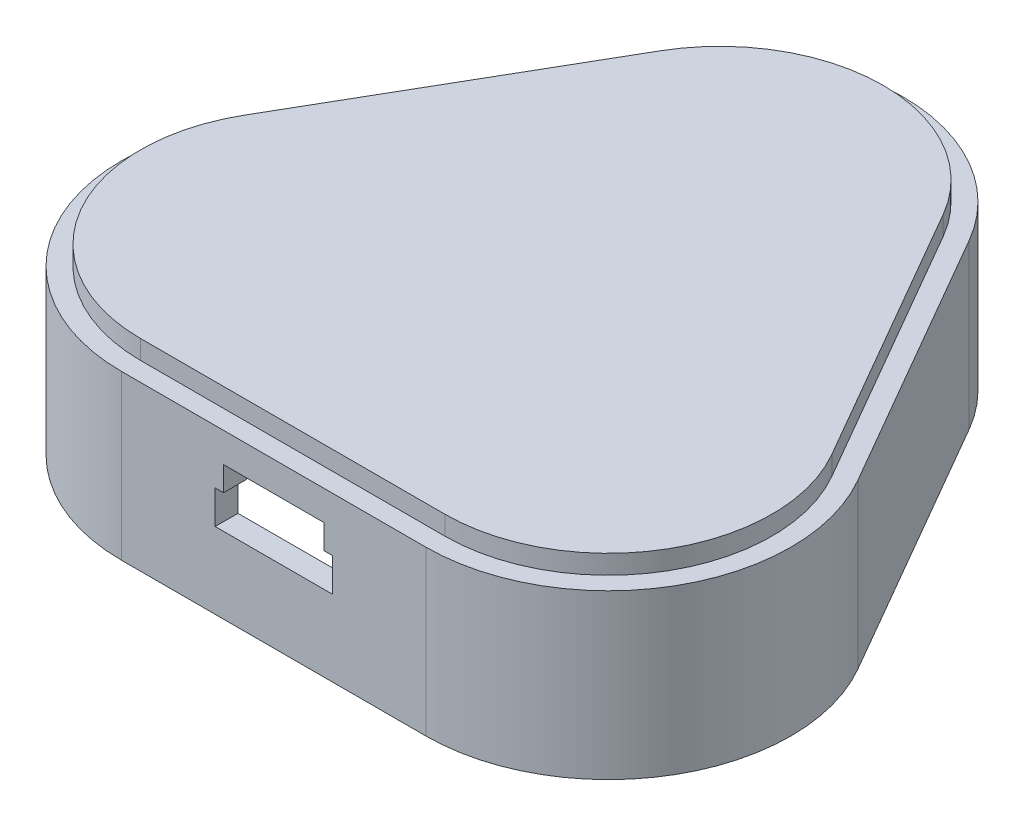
ISO-10303-21;
HEADER;
FILE_DESCRIPTION(('STEP AP214'),'2;1');
FILE_NAME('part.step','',(''),(''),'','','');
FILE_SCHEMA(('AUTOMOTIVE_DESIGN { 1 0 10303 214 1 1 1 1 }'));
ENDSEC;
DATA;
#1=APPLICATION_CONTEXT('core data for automotive mechanical design processes');
#2=APPLICATION_PROTOCOL_DEFINITION('international standard','automotive_design',2000,#1);
#3=PRODUCT_CONTEXT('',#1,'mechanical');
#4=PRODUCT('Part','Part','',(#3));
#5=PRODUCT_RELATED_PRODUCT_CATEGORY('part','',(#4));
#6=PRODUCT_DEFINITION_FORMATION('','',#4);
#7=PRODUCT_DEFINITION_CONTEXT('part definition',#1,'design');
#8=PRODUCT_DEFINITION('design','',#6,#7);
#9=PRODUCT_DEFINITION_SHAPE('','',#8);
#10=(LENGTH_UNIT() NAMED_UNIT(*) SI_UNIT(.MILLI.,.METRE.));
#11=(NAMED_UNIT(*) PLANE_ANGLE_UNIT() SI_UNIT($,.RADIAN.));
#12=(NAMED_UNIT(*) SI_UNIT($,.STERADIAN.) SOLID_ANGLE_UNIT());
#13=UNCERTAINTY_MEASURE_WITH_UNIT(LENGTH_MEASURE(1.E-05),#10,'distance_accuracy_value','');
#14=(GEOMETRIC_REPRESENTATION_CONTEXT(3) GLOBAL_UNCERTAINTY_ASSIGNED_CONTEXT((#13)) GLOBAL_UNIT_ASSIGNED_CONTEXT((#10,
#11,#12)) REPRESENTATION_CONTEXT('',''));
#15=CARTESIAN_POINT('',(0.,0.,0.));
#16=DIRECTION('',(0.,0.,1.));
#17=DIRECTION('',(1.,0.,0.));
#18=AXIS2_PLACEMENT_3D('',#15,#16,#17);
#19=CARTESIAN_POINT('',(0.,10.5,-11.5470053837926));
#20=DIRECTION('',(0.,-1.,0.));
#21=DIRECTION('',(0.,0.,-1.));
#22=AXIS2_PLACEMENT_3D('',#19,#20,#21);
#23=PLANE('',#22);
#24=DIRECTION('',(-0.499999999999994,0.,-0.866025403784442));
#25=VECTOR('',#24,1.);
#26=CARTESIAN_POINT('',(18.2272413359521,10.5,1.02350269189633));
#27=LINE('',#26,#25);
#28=CARTESIAN_POINT('',(12.7712812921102,10.5,-8.42649730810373));
#29=VERTEX_POINT('',#28);
#30=CARTESIAN_POINT('',(8.22724133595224,10.5,-16.2970053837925));
#31=VERTEX_POINT('',#30);
#32=EDGE_CURVE('E546',#29,#31,#27,.T.);
#33=ORIENTED_EDGE('',*,*,#32,.F.);
#34=DIRECTION('',(1.,0.,0.));
#35=VECTOR('',#34,1.);
#36=CARTESIAN_POINT('',(-12.7712812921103,10.5,-8.42649730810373));
#37=LINE('',#36,#35);
#38=CARTESIAN_POINT('',(-12.7712812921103,10.5,-8.42649730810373));
#39=VERTEX_POINT('',#38);
#40=EDGE_CURVE('E320',#39,#29,#37,.T.);
#41=ORIENTED_EDGE('',*,*,#40,.F.);
#42=DIRECTION('',(-0.500000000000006,0.,0.866025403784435));
#43=VECTOR('',#42,1.);
#44=CARTESIAN_POINT('',(-8.22724133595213,10.5,-16.2970053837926));
#45=LINE('',#44,#43);
#46=CARTESIAN_POINT('',(-8.22724133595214,10.5,-16.2970053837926));
#47=VERTEX_POINT('',#46);
#48=EDGE_CURVE('E574',#47,#39,#45,.T.);
#49=ORIENTED_EDGE('',*,*,#48,.F.);
#50=CARTESIAN_POINT('',(0.,10.5,-11.5470053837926));
#51=DIRECTION('',(0.,-1.,0.));
#52=DIRECTION('',(0.,0.,-1.));
#53=AXIS2_PLACEMENT_3D('',#50,#51,#52);
#54=CIRCLE('',#53,9.50000000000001);
#55=EDGE_CURVE('E544',#31,#47,#54,.F.);
#56=ORIENTED_EDGE('',*,*,#55,.F.);
#57=EDGE_LOOP('',(#33,#41,#49,#56));
#58=FACE_BOUND('',#57,.T.);
#59=ADVANCED_FACE('F37',(#58),#23,.T.);
#60=CARTESIAN_POINT('',(-13.9259818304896,10.5,-6.42649730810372));
#61=VERTEX_POINT('',#60);
#62=CARTESIAN_POINT('',(-18.2272413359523,10.5,1.02350269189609));
#63=VERTEX_POINT('',#62);
#64=EDGE_CURVE('E557',#61,#63,#45,.T.);
#65=ORIENTED_EDGE('',*,*,#64,.F.);
#66=DIRECTION('',(-1.,0.,0.));
#67=VECTOR('',#66,1.);
#68=CARTESIAN_POINT('',(-13.9259818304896,10.5,-6.42649730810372));
#69=LINE('',#68,#67);
#70=CARTESIAN_POINT('',(13.9259818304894,10.5,-6.42649730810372));
#71=VERTEX_POINT('',#70);
#72=EDGE_CURVE('E323',#71,#61,#69,.T.);
#73=ORIENTED_EDGE('',*,*,#72,.F.);
#74=CARTESIAN_POINT('',(18.2272413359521,10.5,1.02350269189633));
#75=VERTEX_POINT('',#74);
#76=EDGE_CURVE('E301',#75,#71,#27,.T.);
#77=ORIENTED_EDGE('',*,*,#76,.F.);
#78=CARTESIAN_POINT('',(9.99999999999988,10.5,5.77350269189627));
#79=DIRECTION('',(0.,-1.,0.));
#80=DIRECTION('',(0.,0.,-1.));
#81=AXIS2_PLACEMENT_3D('',#78,#79,#80);
#82=CIRCLE('',#81,9.5);
#83=CARTESIAN_POINT('',(9.99999999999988,10.5,15.2735026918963));
#84=VERTEX_POINT('',#83);
#85=EDGE_CURVE('E549',#84,#75,#82,.F.);
#86=ORIENTED_EDGE('',*,*,#85,.F.);
#87=DIRECTION('',(1.,0.,0.));
#88=VECTOR('',#87,1.);
#89=CARTESIAN_POINT('',(-10.0000000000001,10.5,15.2735026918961));
#90=LINE('',#89,#88);
#91=CARTESIAN_POINT('',(8.9999999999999,10.5,15.2735026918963));
#92=VERTEX_POINT('',#91);
#93=EDGE_CURVE('E551',#92,#84,#90,.T.);
#94=ORIENTED_EDGE('',*,*,#93,.F.);
#95=DIRECTION('',(0.,0.,-1.));
#96=VECTOR('',#95,1.);
#97=CARTESIAN_POINT('',(8.99999999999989,10.5,16.2735026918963));
#98=LINE('',#97,#96);
#99=CARTESIAN_POINT('',(8.99999999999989,10.5,16.2735026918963));
#100=VERTEX_POINT('',#99);
#101=EDGE_CURVE('E353',#100,#92,#98,.T.);
#102=ORIENTED_EDGE('',*,*,#101,.F.);
#103=DIRECTION('',(1.,0.,0.));
#104=VECTOR('',#103,1.);
#105=CARTESIAN_POINT('',(-9.00000000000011,10.5,16.2735026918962));
#106=LINE('',#105,#104);
#107=CARTESIAN_POINT('',(-9.00000000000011,10.5,16.2735026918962));
#108=VERTEX_POINT('',#107);
#109=EDGE_CURVE('E331',#108,#100,#106,.T.);
#110=ORIENTED_EDGE('',*,*,#109,.F.);
#111=DIRECTION('',(0.,0.,-1.));
#112=VECTOR('',#111,1.);
#113=CARTESIAN_POINT('',(-9.00000000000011,10.5,16.2735026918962));
#114=LINE('',#113,#112);
#115=CARTESIAN_POINT('',(-9.00000000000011,10.5,15.2735026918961));
#116=VERTEX_POINT('',#115);
#117=EDGE_CURVE('E341',#108,#116,#114,.T.);
#118=ORIENTED_EDGE('',*,*,#117,.T.);
#119=CARTESIAN_POINT('',(-10.0000000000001,10.5,15.2735026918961));
#120=VERTEX_POINT('',#119);
#121=EDGE_CURVE('E552',#120,#116,#90,.T.);
#122=ORIENTED_EDGE('',*,*,#121,.F.);
#123=CARTESIAN_POINT('',(-10.0000000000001,10.5,5.77350269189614));
#124=DIRECTION('',(0.,-1.,0.));
#125=DIRECTION('',(0.,0.,-1.));
#126=AXIS2_PLACEMENT_3D('',#123,#124,#125);
#127=CIRCLE('',#126,9.5);
#128=EDGE_CURVE('E555',#63,#120,#127,.F.);
#129=ORIENTED_EDGE('',*,*,#128,.F.);
#130=EDGE_LOOP('',(#65,#73,#77,#86,#94,#102,#110,#118,#122,#129));
#131=FACE_BOUND('',#130,.T.);
#132=ADVANCED_FACE('F621',(#131),#23,.T.);
#133=CARTESIAN_POINT('',(-8.22724133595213,65.293332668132,-16.2970053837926));
#134=DIRECTION('',(-0.866025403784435,0.,-0.500000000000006));
#135=DIRECTION('',(-0.500000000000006,0.,0.866025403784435));
#136=AXIS2_PLACEMENT_3D('',#133,#134,#135);
#137=PLANE('',#136);
#138=DIRECTION('',(0.,1.,0.));
#139=VECTOR('',#138,1.);
#140=CARTESIAN_POINT('',(-12.7712812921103,7.5,-8.42649730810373));
#141=LINE('',#140,#139);
#142=CARTESIAN_POINT('',(-12.7712812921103,7.5,-8.42649730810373));
#143=VERTEX_POINT('',#142);
#144=EDGE_CURVE('E52',#143,#39,#141,.T.);
#145=ORIENTED_EDGE('',*,*,#144,.F.);
#146=DIRECTION('',(0.500000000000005,0.,-0.866025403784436));
#147=VECTOR('',#146,1.);
#148=CARTESIAN_POINT('',(-12.7712812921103,7.5,-8.42649730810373));
#149=LINE('',#148,#147);
#150=CARTESIAN_POINT('',(-13.9259818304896,7.5,-6.42649730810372));
#151=VERTEX_POINT('',#150);
#152=EDGE_CURVE('E57',#151,#143,#149,.T.);
#153=ORIENTED_EDGE('',*,*,#152,.F.);
#154=DIRECTION('',(0.,1.,0.));
#155=VECTOR('',#154,1.);
#156=CARTESIAN_POINT('',(-13.9259818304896,7.5,-6.42649730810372));
#157=LINE('',#156,#155);
#158=EDGE_CURVE('E306',#151,#61,#157,.T.);
#159=ORIENTED_EDGE('',*,*,#158,.T.);
#160=ORIENTED_EDGE('',*,*,#64,.T.);
#161=DIRECTION('',(0.,-1.,0.));
#162=VECTOR('',#161,1.);
#163=CARTESIAN_POINT('',(-18.2272413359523,65.293332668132,1.02350269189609));
#164=LINE('',#163,#162);
#165=CARTESIAN_POINT('',(-18.2272413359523,1.25,1.02350269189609));
#166=VERTEX_POINT('',#165);
#167=EDGE_CURVE('E543',#63,#166,#164,.T.);
#168=ORIENTED_EDGE('',*,*,#167,.T.);
#169=DIRECTION('',(-0.500000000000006,0.,0.866025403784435));
#170=VECTOR('',#169,1.);
#171=CARTESIAN_POINT('',(-8.22724133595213,1.25,-16.2970053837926));
#172=LINE('',#171,#170);
#173=CARTESIAN_POINT('',(-8.22724133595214,1.25,-16.2970053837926));
#174=VERTEX_POINT('',#173);
#175=EDGE_CURVE('E45',#174,#166,#172,.T.);
#176=ORIENTED_EDGE('',*,*,#175,.F.);
#177=DIRECTION('',(0.,-1.,0.));
#178=VECTOR('',#177,1.);
#179=CARTESIAN_POINT('',(-8.22724133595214,65.293332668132,-16.2970053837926));
#180=LINE('',#179,#178);
#181=EDGE_CURVE('E569',#47,#174,#180,.T.);
#182=ORIENTED_EDGE('',*,*,#181,.F.);
#183=ORIENTED_EDGE('',*,*,#48,.T.);
#184=EDGE_LOOP('',(#145,#153,#159,#160,#168,#176,#182,#183));
#185=FACE_BOUND('',#184,.T.);
#186=ADVANCED_FACE('F616',(#185),#137,.F.);
#187=CARTESIAN_POINT('',(18.2272413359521,65.293332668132,1.02350269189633));
#188=DIRECTION('',(0.866025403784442,0.,-0.499999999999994));
#189=DIRECTION('',(-0.499999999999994,0.,-0.866025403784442));
#190=AXIS2_PLACEMENT_3D('',#187,#188,#189);
#191=PLANE('',#190);
#192=DIRECTION('',(0.,1.,0.));
#193=VECTOR('',#192,1.);
#194=CARTESIAN_POINT('',(12.7712812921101,7.5,-8.42649730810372));
#195=LINE('',#194,#193);
#196=CARTESIAN_POINT('',(12.7712812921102,7.5,-8.42649730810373));
#197=VERTEX_POINT('',#196);
#198=EDGE_CURVE('E305',#197,#29,#195,.T.);
#199=ORIENTED_EDGE('',*,*,#198,.T.);
#200=ORIENTED_EDGE('',*,*,#32,.T.);
#201=DIRECTION('',(0.,-1.,0.));
#202=VECTOR('',#201,1.);
#203=CARTESIAN_POINT('',(8.22724133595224,65.293332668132,-16.2970053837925));
#204=LINE('',#203,#202);
#205=CARTESIAN_POINT('',(8.22724133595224,1.25,-16.2970053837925));
#206=VERTEX_POINT('',#205);
#207=EDGE_CURVE('E566',#31,#206,#204,.T.);
#208=ORIENTED_EDGE('',*,*,#207,.T.);
#209=DIRECTION('',(-0.499999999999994,0.,-0.866025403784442));
#210=VECTOR('',#209,1.);
#211=CARTESIAN_POINT('',(18.2272413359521,1.25,1.02350269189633));
#212=LINE('',#211,#210);
#213=CARTESIAN_POINT('',(18.2272413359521,1.25,1.02350269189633));
#214=VERTEX_POINT('',#213);
#215=EDGE_CURVE('E535',#214,#206,#212,.T.);
#216=ORIENTED_EDGE('',*,*,#215,.F.);
#217=DIRECTION('',(0.,-1.,0.));
#218=VECTOR('',#217,1.);
#219=CARTESIAN_POINT('',(18.2272413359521,65.293332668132,1.02350269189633));
#220=LINE('',#219,#218);
#221=EDGE_CURVE('E563',#75,#214,#220,.T.);
#222=ORIENTED_EDGE('',*,*,#221,.F.);
#223=ORIENTED_EDGE('',*,*,#76,.T.);
#224=DIRECTION('',(0.,1.,0.));
#225=VECTOR('',#224,1.);
#226=CARTESIAN_POINT('',(13.9259818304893,7.5,-6.42649730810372));
#227=LINE('',#226,#225);
#228=CARTESIAN_POINT('',(13.9259818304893,7.5,-6.42649730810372));
#229=VERTEX_POINT('',#228);
#230=EDGE_CURVE('E294',#229,#71,#227,.T.);
#231=ORIENTED_EDGE('',*,*,#230,.F.);
#232=DIRECTION('',(0.5,0.,0.866025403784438));
#233=VECTOR('',#232,1.);
#234=CARTESIAN_POINT('',(12.7712812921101,7.5,-8.42649730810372));
#235=LINE('',#234,#233);
#236=EDGE_CURVE('E297',#197,#229,#235,.T.);
#237=ORIENTED_EDGE('',*,*,#236,.F.);
#238=EDGE_LOOP('',(#199,#200,#208,#216,#222,#223,#231,#237));
#239=FACE_BOUND('',#238,.T.);
#240=ADVANCED_FACE('F296',(#239),#191,.F.);
#241=CARTESIAN_POINT('',(0.,12.,-11.5470053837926));
#242=DIRECTION('',(0.,-1.,0.));
#243=DIRECTION('',(0.,0.,-1.));
#244=AXIS2_PLACEMENT_3D('',#241,#242,#243);
#245=CYLINDRICAL_SURFACE('',#244,12.);
#246=CARTESIAN_POINT('',(0.,10.75,-11.5470053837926));
#247=DIRECTION('',(0.,1.,0.));
#248=DIRECTION('',(0.,0.,1.));
#249=AXIS2_PLACEMENT_3D('',#246,#247,#248);
#250=CIRCLE('',#249,12.);
#251=CARTESIAN_POINT('',(10.3923048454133,10.75,-17.5470053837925));
#252=VERTEX_POINT('',#251);
#253=CARTESIAN_POINT('',(-10.3923048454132,10.75,-17.5470053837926));
#254=VERTEX_POINT('',#253);
#255=EDGE_CURVE('E463',#252,#254,#250,.T.);
#256=ORIENTED_EDGE('',*,*,#255,.F.);
#257=DIRECTION('',(0.,-1.,0.));
#258=VECTOR('',#257,1.);
#259=CARTESIAN_POINT('',(10.3923048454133,12.,-17.5470053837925));
#260=LINE('',#259,#258);
#261=CARTESIAN_POINT('',(10.3923048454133,0.,-17.5470053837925));
#262=VERTEX_POINT('',#261);
#263=EDGE_CURVE('E594',#252,#262,#260,.T.);
#264=ORIENTED_EDGE('',*,*,#263,.T.);
#265=CARTESIAN_POINT('',(0.,0.,-11.5470053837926));
#266=DIRECTION('',(0.,1.,0.));
#267=DIRECTION('',(0.,0.,-1.));
#268=AXIS2_PLACEMENT_3D('',#265,#266,#267);
#269=CIRCLE('',#268,12.);
#270=CARTESIAN_POINT('',(-10.3923048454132,0.,-17.5470053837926));
#271=VERTEX_POINT('',#270);
#272=EDGE_CURVE('E576',#262,#271,#269,.T.);
#273=ORIENTED_EDGE('',*,*,#272,.T.);
#274=DIRECTION('',(0.,-1.,0.));
#275=VECTOR('',#274,1.);
#276=CARTESIAN_POINT('',(-10.3923048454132,12.,-17.5470053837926));
#277=LINE('',#276,#275);
#278=EDGE_CURVE('E604',#254,#271,#277,.T.);
#279=ORIENTED_EDGE('',*,*,#278,.F.);
#280=EDGE_LOOP('',(#256,#264,#273,#279));
#281=FACE_BOUND('',#280,.T.);
#282=ADVANCED_FACE('F39',(#281),#245,.T.);
#283=CARTESIAN_POINT('',(-10.3923048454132,12.,-17.5470053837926));
#284=DIRECTION('',(0.866025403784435,0.,0.500000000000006));
#285=DIRECTION('',(0.500000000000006,0.,-0.866025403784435));
#286=AXIS2_PLACEMENT_3D('',#283,#284,#285);
#287=PLANE('',#286);
#288=DIRECTION('',(-0.500000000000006,0.,0.866025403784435));
#289=VECTOR('',#288,1.);
#290=CARTESIAN_POINT('',(-10.3923048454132,10.75,-17.5470053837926));
#291=LINE('',#290,#289);
#292=CARTESIAN_POINT('',(-20.3923048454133,10.75,-0.226497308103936));
#293=VERTEX_POINT('',#292);
#294=EDGE_CURVE('E475',#254,#293,#291,.T.);
#295=ORIENTED_EDGE('',*,*,#294,.F.);
#296=ORIENTED_EDGE('',*,*,#278,.T.);
#297=DIRECTION('',(-0.500000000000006,0.,0.866025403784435));
#298=VECTOR('',#297,1.);
#299=CARTESIAN_POINT('',(-10.3923048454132,0.,-17.5470053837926));
#300=LINE('',#299,#298);
#301=CARTESIAN_POINT('',(-20.3923048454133,0.,-0.226497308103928));
#302=VERTEX_POINT('',#301);
#303=EDGE_CURVE('E579',#271,#302,#300,.T.);
#304=ORIENTED_EDGE('',*,*,#303,.T.);
#305=DIRECTION('',(0.,-1.,0.));
#306=VECTOR('',#305,1.);
#307=CARTESIAN_POINT('',(-20.3923048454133,12.,-0.226497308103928));
#308=LINE('',#307,#306);
#309=EDGE_CURVE('E602',#293,#302,#308,.T.);
#310=ORIENTED_EDGE('',*,*,#309,.F.);
#311=EDGE_LOOP('',(#295,#296,#304,#310));
#312=FACE_BOUND('',#311,.T.);
#313=ADVANCED_FACE('F701',(#312),#287,.F.);
#314=CARTESIAN_POINT('',(-10.0000000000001,12.,5.77350269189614));
#315=DIRECTION('',(0.,-1.,0.));
#316=DIRECTION('',(0.,0.,-1.));
#317=AXIS2_PLACEMENT_3D('',#314,#315,#316);
#318=CYLINDRICAL_SURFACE('',#317,12.);
#319=CARTESIAN_POINT('',(-10.0000000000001,10.75,5.77350269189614));
#320=DIRECTION('',(0.,1.,0.));
#321=DIRECTION('',(0.,0.,1.));
#322=AXIS2_PLACEMENT_3D('',#319,#320,#321);
#323=CIRCLE('',#322,12.);
#324=CARTESIAN_POINT('',(-10.0000000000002,10.75,17.7735026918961));
#325=VERTEX_POINT('',#324);
#326=EDGE_CURVE('E477',#293,#325,#323,.T.);
#327=ORIENTED_EDGE('',*,*,#326,.F.);
#328=ORIENTED_EDGE('',*,*,#309,.T.);
#329=CARTESIAN_POINT('',(-10.0000000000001,0.,5.77350269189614));
#330=DIRECTION('',(0.,1.,0.));
#331=DIRECTION('',(0.,0.,1.));
#332=AXIS2_PLACEMENT_3D('',#329,#330,#331);
#333=CIRCLE('',#332,12.);
#334=CARTESIAN_POINT('',(-10.0000000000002,0.,17.7735026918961));
#335=VERTEX_POINT('',#334);
#336=EDGE_CURVE('E582',#302,#335,#333,.T.);
#337=ORIENTED_EDGE('',*,*,#336,.T.);
#338=DIRECTION('',(0.,-1.,0.));
#339=VECTOR('',#338,1.);
#340=CARTESIAN_POINT('',(-10.0000000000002,12.,17.7735026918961));
#341=LINE('',#340,#339);
#342=EDGE_CURVE('E600',#325,#335,#341,.T.);
#343=ORIENTED_EDGE('',*,*,#342,.F.);
#344=EDGE_LOOP('',(#327,#328,#337,#343));
#345=FACE_BOUND('',#344,.T.);
#346=ADVANCED_FACE('F698',(#345),#318,.T.);
#347=CARTESIAN_POINT('',(9.9999999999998,12.,17.7735026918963));
#348=DIRECTION('',(0.,0.,-1.));
#349=DIRECTION('',(-1.,0.,0.));
#350=AXIS2_PLACEMENT_3D('',#347,#348,#349);
#351=PLANE('',#350);
#352=DIRECTION('',(-1.,0.,0.));
#353=VECTOR('',#352,1.);
#354=CARTESIAN_POINT('',(-3.30000000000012,7.2,17.7735026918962));
#355=LINE('',#354,#353);
#356=CARTESIAN_POINT('',(-3.30000000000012,7.2,17.7735026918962));
#357=VERTEX_POINT('',#356);
#358=CARTESIAN_POINT('',(-3.85000000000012,7.2,17.7735026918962));
#359=VERTEX_POINT('',#358);
#360=EDGE_CURVE('E391',#357,#359,#355,.T.);
#361=ORIENTED_EDGE('',*,*,#360,.F.);
#362=DIRECTION('',(0.,-1.,0.));
#363=VECTOR('',#362,1.);
#364=CARTESIAN_POINT('',(-3.30000000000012,8.8,17.7735026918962));
#365=LINE('',#364,#363);
#366=CARTESIAN_POINT('',(-3.30000000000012,8.8,17.7735026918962));
#367=VERTEX_POINT('',#366);
#368=EDGE_CURVE('E394',#367,#357,#365,.T.);
#369=ORIENTED_EDGE('',*,*,#368,.F.);
#370=DIRECTION('',(-1.,0.,0.));
#371=VECTOR('',#370,1.);
#372=CARTESIAN_POINT('',(3.29999999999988,8.8,17.7735026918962));
#373=LINE('',#372,#371);
#374=CARTESIAN_POINT('',(3.2999999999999,8.8,17.7735026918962));
#375=VERTEX_POINT('',#374);
#376=EDGE_CURVE('E401',#375,#367,#373,.T.);
#377=ORIENTED_EDGE('',*,*,#376,.F.);
#378=DIRECTION('',(0.,1.,0.));
#379=VECTOR('',#378,1.);
#380=CARTESIAN_POINT('',(3.29999999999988,8.8,17.7735026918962));
#381=LINE('',#380,#379);
#382=CARTESIAN_POINT('',(3.29999999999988,7.2,17.7735026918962));
#383=VERTEX_POINT('',#382);
#384=EDGE_CURVE('E377',#383,#375,#381,.T.);
#385=ORIENTED_EDGE('',*,*,#384,.F.);
#386=DIRECTION('',(-1.,0.,0.));
#387=VECTOR('',#386,1.);
#388=CARTESIAN_POINT('',(3.29999999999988,7.2,17.7735026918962));
#389=LINE('',#388,#387);
#390=CARTESIAN_POINT('',(3.84999999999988,7.2,17.7735026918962));
#391=VERTEX_POINT('',#390);
#392=EDGE_CURVE('E379',#391,#383,#389,.T.);
#393=ORIENTED_EDGE('',*,*,#392,.F.);
#394=DIRECTION('',(0.,1.,0.));
#395=VECTOR('',#394,1.);
#396=CARTESIAN_POINT('',(3.84999999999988,7.2,17.7735026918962));
#397=LINE('',#396,#395);
#398=CARTESIAN_POINT('',(3.84999999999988,5.,17.7735026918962));
#399=VERTEX_POINT('',#398);
#400=EDGE_CURVE('E382',#399,#391,#397,.T.);
#401=ORIENTED_EDGE('',*,*,#400,.F.);
#402=DIRECTION('',(1.,0.,0.));
#403=VECTOR('',#402,1.);
#404=CARTESIAN_POINT('',(-3.85000000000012,5.,17.7735026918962));
#405=LINE('',#404,#403);
#406=CARTESIAN_POINT('',(-3.85000000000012,5.,17.7735026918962));
#407=VERTEX_POINT('',#406);
#408=EDGE_CURVE('E385',#407,#399,#405,.T.);
#409=ORIENTED_EDGE('',*,*,#408,.F.);
#410=DIRECTION('',(0.,-1.,0.));
#411=VECTOR('',#410,1.);
#412=CARTESIAN_POINT('',(-3.85000000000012,7.2,17.7735026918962));
#413=LINE('',#412,#411);
#414=EDGE_CURVE('E388',#359,#407,#413,.T.);
#415=ORIENTED_EDGE('',*,*,#414,.F.);
#416=EDGE_LOOP('',(#361,#369,#377,#385,#393,#401,#409,#415));
#417=FACE_BOUND('',#416,.T.);
#418=DIRECTION('',(1.,0.,0.));
#419=VECTOR('',#418,1.);
#420=CARTESIAN_POINT('',(-10.0000000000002,10.75,17.7735026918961));
#421=LINE('',#420,#419);
#422=CARTESIAN_POINT('',(9.99999999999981,10.75,17.7735026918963));
#423=VERTEX_POINT('',#422);
#424=EDGE_CURVE('E479',#325,#423,#421,.T.);
#425=ORIENTED_EDGE('',*,*,#424,.F.);
#426=ORIENTED_EDGE('',*,*,#342,.T.);
#427=DIRECTION('',(1.,0.,0.));
#428=VECTOR('',#427,1.);
#429=CARTESIAN_POINT('',(9.9999999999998,0.,17.7735026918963));
#430=LINE('',#429,#428);
#431=CARTESIAN_POINT('',(9.9999999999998,0.,17.7735026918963));
#432=VERTEX_POINT('',#431);
#433=EDGE_CURVE('E585',#335,#432,#430,.T.);
#434=ORIENTED_EDGE('',*,*,#433,.T.);
#435=DIRECTION('',(0.,-1.,0.));
#436=VECTOR('',#435,1.);
#437=CARTESIAN_POINT('',(9.9999999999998,12.,17.7735026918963));
#438=LINE('',#437,#436);
#439=EDGE_CURVE('E598',#423,#432,#438,.T.);
#440=ORIENTED_EDGE('',*,*,#439,.F.);
#441=EDGE_LOOP('',(#425,#426,#434,#440));
#442=FACE_BOUND('',#441,.T.);
#443=ADVANCED_FACE('F694',(#417,#442),#351,.F.);
#444=CARTESIAN_POINT('',(9.99999999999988,12.,5.77350269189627));
#445=DIRECTION('',(0.,-1.,0.));
#446=DIRECTION('',(0.,0.,-1.));
#447=AXIS2_PLACEMENT_3D('',#444,#445,#446);
#448=CYLINDRICAL_SURFACE('',#447,12.);
#449=CARTESIAN_POINT('',(9.99999999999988,10.75,5.77350269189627));
#450=DIRECTION('',(0.,1.,0.));
#451=DIRECTION('',(0.,0.,1.));
#452=AXIS2_PLACEMENT_3D('',#449,#450,#451);
#453=CIRCLE('',#452,12.);
#454=CARTESIAN_POINT('',(20.3923048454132,10.75,-0.226497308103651));
#455=VERTEX_POINT('',#454);
#456=EDGE_CURVE('E481',#423,#455,#453,.T.);
#457=ORIENTED_EDGE('',*,*,#456,.F.);
#458=ORIENTED_EDGE('',*,*,#439,.T.);
#459=CARTESIAN_POINT('',(9.99999999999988,0.,5.77350269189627));
#460=DIRECTION('',(0.,1.,0.));
#461=DIRECTION('',(0.,0.,-1.));
#462=AXIS2_PLACEMENT_3D('',#459,#460,#461);
#463=CIRCLE('',#462,12.);
#464=CARTESIAN_POINT('',(20.3923048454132,0.,-0.226497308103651));
#465=VERTEX_POINT('',#464);
#466=EDGE_CURVE('E588',#432,#465,#463,.T.);
#467=ORIENTED_EDGE('',*,*,#466,.T.);
#468=DIRECTION('',(0.,-1.,0.));
#469=VECTOR('',#468,1.);
#470=CARTESIAN_POINT('',(20.3923048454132,12.,-0.226497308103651));
#471=LINE('',#470,#469);
#472=EDGE_CURVE('E596',#455,#465,#471,.T.);
#473=ORIENTED_EDGE('',*,*,#472,.F.);
#474=EDGE_LOOP('',(#457,#458,#467,#473));
#475=FACE_BOUND('',#474,.T.);
#476=ADVANCED_FACE('F690',(#475),#448,.T.);
#477=CARTESIAN_POINT('',(10.3923048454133,12.,-17.5470053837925));
#478=DIRECTION('',(-0.866025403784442,0.,0.499999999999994));
#479=DIRECTION('',(0.499999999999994,0.,0.866025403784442));
#480=AXIS2_PLACEMENT_3D('',#477,#478,#479);
#481=PLANE('',#480);
#482=DIRECTION('',(-0.499999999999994,0.,-0.866025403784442));
#483=VECTOR('',#482,1.);
#484=CARTESIAN_POINT('',(20.3923048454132,10.75,-0.226497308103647));
#485=LINE('',#484,#483);
#486=EDGE_CURVE('E483',#455,#252,#485,.T.);
#487=ORIENTED_EDGE('',*,*,#486,.F.);
#488=ORIENTED_EDGE('',*,*,#472,.T.);
#489=DIRECTION('',(-0.499999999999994,0.,-0.866025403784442));
#490=VECTOR('',#489,1.);
#491=CARTESIAN_POINT('',(10.3923048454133,0.,-17.5470053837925));
#492=LINE('',#491,#490);
#493=EDGE_CURVE('E591',#465,#262,#492,.T.);
#494=ORIENTED_EDGE('',*,*,#493,.T.);
#495=ORIENTED_EDGE('',*,*,#263,.F.);
#496=EDGE_LOOP('',(#487,#488,#494,#495));
#497=FACE_BOUND('',#496,.T.);
#498=ADVANCED_FACE('F686',(#497),#481,.F.);
#499=CARTESIAN_POINT('',(0.,0.,-11.5470053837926));
#500=DIRECTION('',(0.,-1.,0.));
#501=DIRECTION('',(0.,0.,-1.));
#502=AXIS2_PLACEMENT_3D('',#499,#500,#501);
#503=PLANE('',#502);
#504=CARTESIAN_POINT('',(0.,0.,-11.5470053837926));
#505=DIRECTION('',(0.,-1.,0.));
#506=DIRECTION('',(0.,0.,-1.));
#507=AXIS2_PLACEMENT_3D('',#504,#505,#506);
#508=CIRCLE('',#507,10.75);
#509=CARTESIAN_POINT('',(-9.30977309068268,0.,-16.9220053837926));
#510=VERTEX_POINT('',#509);
#511=CARTESIAN_POINT('',(9.30977309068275,0.,-16.9220053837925));
#512=VERTEX_POINT('',#511);
#513=EDGE_CURVE('E485',#510,#512,#508,.T.);
#514=ORIENTED_EDGE('',*,*,#513,.F.);
#515=DIRECTION('',(0.500000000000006,0.,-0.866025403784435));
#516=VECTOR('',#515,1.);
#517=CARTESIAN_POINT('',(-19.3097730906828,0.,0.39850269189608));
#518=LINE('',#517,#516);
#519=CARTESIAN_POINT('',(-19.3097730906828,0.,0.398502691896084));
#520=VERTEX_POINT('',#519);
#521=EDGE_CURVE('E490',#520,#510,#518,.T.);
#522=ORIENTED_EDGE('',*,*,#521,.F.);
#523=CARTESIAN_POINT('',(-10.0000000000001,0.,5.77350269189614));
#524=DIRECTION('',(0.,-1.,0.));
#525=DIRECTION('',(0.,0.,-1.));
#526=AXIS2_PLACEMENT_3D('',#523,#524,#525);
#527=CIRCLE('',#526,10.75);
#528=CARTESIAN_POINT('',(-10.0000000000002,0.,16.5235026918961));
#529=VERTEX_POINT('',#528);
#530=EDGE_CURVE('E516',#529,#520,#527,.T.);
#531=ORIENTED_EDGE('',*,*,#530,.F.);
#532=DIRECTION('',(-1.,0.,0.));
#533=VECTOR('',#532,1.);
#534=CARTESIAN_POINT('',(9.99999999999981,0.,16.5235026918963));
#535=LINE('',#534,#533);
#536=CARTESIAN_POINT('',(9.99999999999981,0.,16.5235026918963));
#537=VERTEX_POINT('',#536);
#538=EDGE_CURVE('E513',#537,#529,#535,.T.);
#539=ORIENTED_EDGE('',*,*,#538,.F.);
#540=CARTESIAN_POINT('',(9.99999999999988,0.,5.77350269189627));
#541=DIRECTION('',(0.,-1.,0.));
#542=DIRECTION('',(0.,0.,-1.));
#543=AXIS2_PLACEMENT_3D('',#540,#541,#542);
#544=CIRCLE('',#543,10.75);
#545=CARTESIAN_POINT('',(19.3097730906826,0.,0.398502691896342));
#546=VERTEX_POINT('',#545);
#547=EDGE_CURVE('E510',#546,#537,#544,.T.);
#548=ORIENTED_EDGE('',*,*,#547,.F.);
#549=DIRECTION('',(0.499999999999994,0.,0.866025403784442));
#550=VECTOR('',#549,1.);
#551=CARTESIAN_POINT('',(9.30977309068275,0.,-16.9220053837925));
#552=LINE('',#551,#550);
#553=EDGE_CURVE('E507',#512,#546,#552,.T.);
#554=ORIENTED_EDGE('',*,*,#553,.F.);
#555=EDGE_LOOP('',(#514,#522,#531,#539,#548,#554));
#556=FACE_BOUND('',#555,.T.);
#557=ORIENTED_EDGE('',*,*,#272,.F.);
#558=ORIENTED_EDGE('',*,*,#493,.F.);
#559=ORIENTED_EDGE('',*,*,#466,.F.);
#560=ORIENTED_EDGE('',*,*,#433,.F.);
#561=ORIENTED_EDGE('',*,*,#336,.F.);
#562=ORIENTED_EDGE('',*,*,#303,.F.);
#563=EDGE_LOOP('',(#557,#558,#559,#560,#561,#562));
#564=FACE_BOUND('',#563,.T.);
#565=ADVANCED_FACE('F683',(#556,#564),#503,.T.);
#566=CARTESIAN_POINT('',(0.,1.25,-11.5470053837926));
#567=DIRECTION('',(0.,-1.,0.));
#568=DIRECTION('',(0.,0.,-1.));
#569=AXIS2_PLACEMENT_3D('',#566,#567,#568);
#570=PLANE('',#569);
#571=CARTESIAN_POINT('',(0.,1.25,-11.5470053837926));
#572=DIRECTION('',(0.,-1.,0.));
#573=DIRECTION('',(0.,0.,-1.));
#574=AXIS2_PLACEMENT_3D('',#571,#572,#573);
#575=CIRCLE('',#574,10.75);
#576=CARTESIAN_POINT('',(-9.30977309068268,1.25,-16.9220053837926));
#577=VERTEX_POINT('',#576);
#578=CARTESIAN_POINT('',(9.30977309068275,1.25,-16.9220053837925));
#579=VERTEX_POINT('',#578);
#580=EDGE_CURVE('E486',#577,#579,#575,.T.);
#581=ORIENTED_EDGE('',*,*,#580,.T.);
#582=DIRECTION('',(0.499999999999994,0.,0.866025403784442));
#583=VECTOR('',#582,1.);
#584=CARTESIAN_POINT('',(9.30977309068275,1.25,-16.9220053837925));
#585=LINE('',#584,#583);
#586=CARTESIAN_POINT('',(19.3097730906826,1.25,0.398502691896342));
#587=VERTEX_POINT('',#586);
#588=EDGE_CURVE('E489',#579,#587,#585,.T.);
#589=ORIENTED_EDGE('',*,*,#588,.T.);
#590=CARTESIAN_POINT('',(9.99999999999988,1.25,5.77350269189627));
#591=DIRECTION('',(0.,-1.,0.));
#592=DIRECTION('',(0.,0.,-1.));
#593=AXIS2_PLACEMENT_3D('',#590,#591,#592);
#594=CIRCLE('',#593,10.75);
#595=CARTESIAN_POINT('',(9.99999999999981,1.25,16.5235026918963));
#596=VERTEX_POINT('',#595);
#597=EDGE_CURVE('E493',#587,#596,#594,.T.);
#598=ORIENTED_EDGE('',*,*,#597,.T.);
#599=DIRECTION('',(-1.,0.,0.));
#600=VECTOR('',#599,1.);
#601=CARTESIAN_POINT('',(9.99999999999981,1.25,16.5235026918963));
#602=LINE('',#601,#600);
#603=CARTESIAN_POINT('',(-10.0000000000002,1.25,16.5235026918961));
#604=VERTEX_POINT('',#603);
#605=EDGE_CURVE('E496',#596,#604,#602,.T.);
#606=ORIENTED_EDGE('',*,*,#605,.T.);
#607=CARTESIAN_POINT('',(-10.0000000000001,1.25,5.77350269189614));
#608=DIRECTION('',(0.,-1.,0.));
#609=DIRECTION('',(0.,0.,-1.));
#610=AXIS2_PLACEMENT_3D('',#607,#608,#609);
#611=CIRCLE('',#610,10.75);
#612=CARTESIAN_POINT('',(-19.3097730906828,1.25,0.398502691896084));
#613=VERTEX_POINT('',#612);
#614=EDGE_CURVE('E499',#604,#613,#611,.T.);
#615=ORIENTED_EDGE('',*,*,#614,.T.);
#616=DIRECTION('',(0.500000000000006,0.,-0.866025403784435));
#617=VECTOR('',#616,1.);
#618=CARTESIAN_POINT('',(-19.3097730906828,1.25,0.39850269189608));
#619=LINE('',#618,#617);
#620=EDGE_CURVE('E502',#613,#577,#619,.T.);
#621=ORIENTED_EDGE('',*,*,#620,.T.);
#622=EDGE_LOOP('',(#581,#589,#598,#606,#615,#621));
#623=FACE_BOUND('',#622,.T.);
#624=CARTESIAN_POINT('',(-10.0000000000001,1.25,5.77350269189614));
#625=DIRECTION('',(0.,-1.,0.));
#626=DIRECTION('',(0.,0.,-1.));
#627=AXIS2_PLACEMENT_3D('',#624,#625,#626);
#628=CIRCLE('',#627,9.5);
#629=CARTESIAN_POINT('',(-10.0000000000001,1.25,15.2735026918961));
#630=VERTEX_POINT('',#629);
#631=EDGE_CURVE('E541',#166,#630,#628,.F.);
#632=ORIENTED_EDGE('',*,*,#631,.T.);
#633=DIRECTION('',(1.,0.,0.));
#634=VECTOR('',#633,1.);
#635=CARTESIAN_POINT('',(-10.0000000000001,1.25,15.2735026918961));
#636=LINE('',#635,#634);
#637=CARTESIAN_POINT('',(9.99999999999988,1.25,15.2735026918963));
#638=VERTEX_POINT('',#637);
#639=EDGE_CURVE('E539',#630,#638,#636,.T.);
#640=ORIENTED_EDGE('',*,*,#639,.T.);
#641=CARTESIAN_POINT('',(9.99999999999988,1.25,5.77350269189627));
#642=DIRECTION('',(0.,-1.,0.));
#643=DIRECTION('',(0.,0.,-1.));
#644=AXIS2_PLACEMENT_3D('',#641,#642,#643);
#645=CIRCLE('',#644,9.5);
#646=EDGE_CURVE('E537',#638,#214,#645,.F.);
#647=ORIENTED_EDGE('',*,*,#646,.T.);
#648=ORIENTED_EDGE('',*,*,#215,.T.);
#649=CARTESIAN_POINT('',(0.,1.25,-11.5470053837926));
#650=DIRECTION('',(0.,-1.,0.));
#651=DIRECTION('',(0.,0.,-1.));
#652=AXIS2_PLACEMENT_3D('',#649,#650,#651);
#653=CIRCLE('',#652,9.50000000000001);
#654=EDGE_CURVE('E523',#206,#174,#653,.F.);
#655=ORIENTED_EDGE('',*,*,#654,.T.);
#656=ORIENTED_EDGE('',*,*,#175,.T.);
#657=EDGE_LOOP('',(#632,#640,#647,#648,#655,#656));
#658=FACE_BOUND('',#657,.T.);
#659=ADVANCED_FACE('F608',(#623,#658),#570,.T.);
#660=CARTESIAN_POINT('',(0.,1.25,-11.5470053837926));
#661=DIRECTION('',(0.,-1.,0.));
#662=DIRECTION('',(0.,0.,-1.));
#663=AXIS2_PLACEMENT_3D('',#660,#661,#662);
#664=CYLINDRICAL_SURFACE('',#663,10.75);
#665=ORIENTED_EDGE('',*,*,#513,.T.);
#666=DIRECTION('',(0.,-1.,0.));
#667=VECTOR('',#666,1.);
#668=CARTESIAN_POINT('',(9.30977309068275,1.25,-16.9220053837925));
#669=LINE('',#668,#667);
#670=EDGE_CURVE('E505',#579,#512,#669,.T.);
#671=ORIENTED_EDGE('',*,*,#670,.F.);
#672=ORIENTED_EDGE('',*,*,#580,.F.);
#673=DIRECTION('',(0.,-1.,0.));
#674=VECTOR('',#673,1.);
#675=CARTESIAN_POINT('',(-9.30977309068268,1.25,-16.9220053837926));
#676=LINE('',#675,#674);
#677=EDGE_CURVE('E521',#577,#510,#676,.T.);
#678=ORIENTED_EDGE('',*,*,#677,.T.);
#679=EDGE_LOOP('',(#665,#671,#672,#678));
#680=FACE_BOUND('',#679,.T.);
#681=ADVANCED_FACE('F661',(#680),#664,.F.);
#682=CARTESIAN_POINT('',(-19.3097730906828,1.25,0.39850269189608));
#683=DIRECTION('',(-0.866025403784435,0.,-0.500000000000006));
#684=DIRECTION('',(-0.500000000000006,0.,0.866025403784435));
#685=AXIS2_PLACEMENT_3D('',#682,#683,#684);
#686=PLANE('',#685);
#687=ORIENTED_EDGE('',*,*,#521,.T.);
#688=ORIENTED_EDGE('',*,*,#677,.F.);
#689=ORIENTED_EDGE('',*,*,#620,.F.);
#690=DIRECTION('',(0.,-1.,0.));
#691=VECTOR('',#690,1.);
#692=CARTESIAN_POINT('',(-19.3097730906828,1.25,0.398502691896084));
#693=LINE('',#692,#691);
#694=EDGE_CURVE('E524',#613,#520,#693,.T.);
#695=ORIENTED_EDGE('',*,*,#694,.T.);
#696=EDGE_LOOP('',(#687,#688,#689,#695));
#697=FACE_BOUND('',#696,.T.);
#698=ADVANCED_FACE('F746',(#697),#686,.F.);
#699=CARTESIAN_POINT('',(-10.0000000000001,1.25,5.77350269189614));
#700=DIRECTION('',(0.,-1.,0.));
#701=DIRECTION('',(0.,0.,-1.));
#702=AXIS2_PLACEMENT_3D('',#699,#700,#701);
#703=CYLINDRICAL_SURFACE('',#702,10.75);
#704=ORIENTED_EDGE('',*,*,#530,.T.);
#705=ORIENTED_EDGE('',*,*,#694,.F.);
#706=ORIENTED_EDGE('',*,*,#614,.F.);
#707=DIRECTION('',(0.,-1.,0.));
#708=VECTOR('',#707,1.);
#709=CARTESIAN_POINT('',(-10.0000000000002,1.25,16.5235026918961));
#710=LINE('',#709,#708);
#711=EDGE_CURVE('E526',#604,#529,#710,.T.);
#712=ORIENTED_EDGE('',*,*,#711,.T.);
#713=EDGE_LOOP('',(#704,#705,#706,#712));
#714=FACE_BOUND('',#713,.T.);
#715=ADVANCED_FACE('F749',(#714),#703,.F.);
#716=CARTESIAN_POINT('',(9.99999999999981,1.25,16.5235026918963));
#717=DIRECTION('',(0.,0.,1.));
#718=DIRECTION('',(1.,0.,0.));
#719=AXIS2_PLACEMENT_3D('',#716,#717,#718);
#720=PLANE('',#719);
#721=ORIENTED_EDGE('',*,*,#538,.T.);
#722=ORIENTED_EDGE('',*,*,#711,.F.);
#723=ORIENTED_EDGE('',*,*,#605,.F.);
#724=DIRECTION('',(0.,-1.,0.));
#725=VECTOR('',#724,1.);
#726=CARTESIAN_POINT('',(9.99999999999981,1.25,16.5235026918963));
#727=LINE('',#726,#725);
#728=EDGE_CURVE('E528',#596,#537,#727,.T.);
#729=ORIENTED_EDGE('',*,*,#728,.T.);
#730=EDGE_LOOP('',(#721,#722,#723,#729));
#731=FACE_BOUND('',#730,.T.);
#732=ADVANCED_FACE('F753',(#731),#720,.F.);
#733=CARTESIAN_POINT('',(9.99999999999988,1.25,5.77350269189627));
#734=DIRECTION('',(0.,-1.,0.));
#735=DIRECTION('',(0.,0.,-1.));
#736=AXIS2_PLACEMENT_3D('',#733,#734,#735);
#737=CYLINDRICAL_SURFACE('',#736,10.75);
#738=ORIENTED_EDGE('',*,*,#547,.T.);
#739=ORIENTED_EDGE('',*,*,#728,.F.);
#740=ORIENTED_EDGE('',*,*,#597,.F.);
#741=DIRECTION('',(0.,-1.,0.));
#742=VECTOR('',#741,1.);
#743=CARTESIAN_POINT('',(19.3097730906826,1.25,0.398502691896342));
#744=LINE('',#743,#742);
#745=EDGE_CURVE('E530',#587,#546,#744,.T.);
#746=ORIENTED_EDGE('',*,*,#745,.T.);
#747=EDGE_LOOP('',(#738,#739,#740,#746));
#748=FACE_BOUND('',#747,.T.);
#749=ADVANCED_FACE('F757',(#748),#737,.F.);
#750=CARTESIAN_POINT('',(9.30977309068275,1.25,-16.9220053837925));
#751=DIRECTION('',(0.866025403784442,0.,-0.499999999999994));
#752=DIRECTION('',(-0.499999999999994,0.,-0.866025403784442));
#753=AXIS2_PLACEMENT_3D('',#750,#751,#752);
#754=PLANE('',#753);
#755=ORIENTED_EDGE('',*,*,#553,.T.);
#756=ORIENTED_EDGE('',*,*,#745,.F.);
#757=ORIENTED_EDGE('',*,*,#588,.F.);
#758=ORIENTED_EDGE('',*,*,#670,.T.);
#759=EDGE_LOOP('',(#755,#756,#757,#758));
#760=FACE_BOUND('',#759,.T.);
#761=ADVANCED_FACE('F671',(#760),#754,.F.);
#762=CARTESIAN_POINT('',(0.,65.293332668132,-11.5470053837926));
#763=DIRECTION('',(0.,-1.,0.));
#764=DIRECTION('',(0.,0.,-1.));
#765=AXIS2_PLACEMENT_3D('',#762,#763,#764);
#766=CYLINDRICAL_SURFACE('',#765,9.50000000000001);
#767=ORIENTED_EDGE('',*,*,#654,.F.);
#768=ORIENTED_EDGE('',*,*,#207,.F.);
#769=ORIENTED_EDGE('',*,*,#55,.T.);
#770=ORIENTED_EDGE('',*,*,#181,.T.);
#771=EDGE_LOOP('',(#767,#768,#769,#770));
#772=FACE_BOUND('',#771,.T.);
#773=ADVANCED_FACE('F634',(#772),#766,.F.);
#774=CARTESIAN_POINT('',(9.99999999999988,65.293332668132,5.77350269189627));
#775=DIRECTION('',(0.,-1.,0.));
#776=DIRECTION('',(0.,0.,-1.));
#777=AXIS2_PLACEMENT_3D('',#774,#775,#776);
#778=CYLINDRICAL_SURFACE('',#777,9.5);
#779=ORIENTED_EDGE('',*,*,#646,.F.);
#780=DIRECTION('',(0.,-1.,0.));
#781=VECTOR('',#780,1.);
#782=CARTESIAN_POINT('',(9.99999999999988,65.293332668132,15.2735026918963));
#783=LINE('',#782,#781);
#784=EDGE_CURVE('E560',#84,#638,#783,.T.);
#785=ORIENTED_EDGE('',*,*,#784,.F.);
#786=ORIENTED_EDGE('',*,*,#85,.T.);
#787=ORIENTED_EDGE('',*,*,#221,.T.);
#788=EDGE_LOOP('',(#779,#785,#786,#787));
#789=FACE_BOUND('',#788,.T.);
#790=ADVANCED_FACE('F630',(#789),#778,.F.);
#791=CARTESIAN_POINT('',(-10.0000000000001,65.293332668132,15.2735026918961));
#792=DIRECTION('',(0.,0.,1.));
#793=DIRECTION('',(1.,0.,0.));
#794=AXIS2_PLACEMENT_3D('',#791,#792,#793);
#795=PLANE('',#794);
#796=ORIENTED_EDGE('',*,*,#121,.T.);
#797=DIRECTION('',(0.,1.,0.));
#798=VECTOR('',#797,1.);
#799=CARTESIAN_POINT('',(-9.0000000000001,10.5,15.2735026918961));
#800=LINE('',#799,#798);
#801=CARTESIAN_POINT('',(-9.0000000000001,2.5,15.2735026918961));
#802=VERTEX_POINT('',#801);
#803=EDGE_CURVE('E327',#802,#116,#800,.T.);
#804=ORIENTED_EDGE('',*,*,#803,.F.);
#805=DIRECTION('',(-1.,0.,0.));
#806=VECTOR('',#805,1.);
#807=CARTESIAN_POINT('',(-9.0000000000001,2.5,15.2735026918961));
#808=LINE('',#807,#806);
#809=CARTESIAN_POINT('',(8.99999999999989,2.5,15.2735026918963));
#810=VERTEX_POINT('',#809);
#811=EDGE_CURVE('E332',#810,#802,#808,.T.);
#812=ORIENTED_EDGE('',*,*,#811,.F.);
#813=DIRECTION('',(0.,-1.,0.));
#814=VECTOR('',#813,1.);
#815=CARTESIAN_POINT('',(8.9999999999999,10.5,15.2735026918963));
#816=LINE('',#815,#814);
#817=EDGE_CURVE('E343',#92,#810,#816,.T.);
#818=ORIENTED_EDGE('',*,*,#817,.F.);
#819=ORIENTED_EDGE('',*,*,#93,.T.);
#820=ORIENTED_EDGE('',*,*,#784,.T.);
#821=ORIENTED_EDGE('',*,*,#639,.F.);
#822=DIRECTION('',(0.,-1.,0.));
#823=VECTOR('',#822,1.);
#824=CARTESIAN_POINT('',(-10.0000000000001,65.293332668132,15.2735026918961));
#825=LINE('',#824,#823);
#826=EDGE_CURVE('E547',#120,#630,#825,.T.);
#827=ORIENTED_EDGE('',*,*,#826,.F.);
#828=EDGE_LOOP('',(#796,#804,#812,#818,#819,#820,#821,#827));
#829=FACE_BOUND('',#828,.T.);
#830=ADVANCED_FACE('F625',(#829),#795,.F.);
#831=CARTESIAN_POINT('',(-10.0000000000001,65.293332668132,5.77350269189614));
#832=DIRECTION('',(0.,-1.,0.));
#833=DIRECTION('',(0.,0.,-1.));
#834=AXIS2_PLACEMENT_3D('',#831,#832,#833);
#835=CYLINDRICAL_SURFACE('',#834,9.5);
#836=ORIENTED_EDGE('',*,*,#631,.F.);
#837=ORIENTED_EDGE('',*,*,#167,.F.);
#838=ORIENTED_EDGE('',*,*,#128,.T.);
#839=ORIENTED_EDGE('',*,*,#826,.T.);
#840=EDGE_LOOP('',(#836,#837,#838,#839));
#841=FACE_BOUND('',#840,.T.);
#842=ADVANCED_FACE('F614',(#841),#835,.F.);
#843=CARTESIAN_POINT('',(0.,10.75,-11.5470053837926));
#844=DIRECTION('',(0.,1.,0.));
#845=DIRECTION('',(0.,0.,1.));
#846=AXIS2_PLACEMENT_3D('',#843,#844,#845);
#847=PLANE('',#846);
#848=DIRECTION('',(-0.499999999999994,0.,-0.866025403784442));
#849=VECTOR('',#848,1.);
#850=CARTESIAN_POINT('',(19.3097730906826,10.75,0.398502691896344));
#851=LINE('',#850,#849);
#852=CARTESIAN_POINT('',(19.3097730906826,10.75,0.398502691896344));
#853=VERTEX_POINT('',#852);
#854=CARTESIAN_POINT('',(9.30977309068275,10.75,-16.9220053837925));
#855=VERTEX_POINT('',#854);
#856=EDGE_CURVE('E441',#853,#855,#851,.T.);
#857=ORIENTED_EDGE('',*,*,#856,.F.);
#858=CARTESIAN_POINT('',(9.99999999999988,10.75,5.77350269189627));
#859=DIRECTION('',(0.,1.,0.));
#860=DIRECTION('',(0.,0.,1.));
#861=AXIS2_PLACEMENT_3D('',#858,#859,#860);
#862=CIRCLE('',#861,10.75);
#863=CARTESIAN_POINT('',(9.99999999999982,10.75,16.5235026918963));
#864=VERTEX_POINT('',#863);
#865=EDGE_CURVE('E438',#864,#853,#862,.T.);
#866=ORIENTED_EDGE('',*,*,#865,.F.);
#867=DIRECTION('',(1.,0.,0.));
#868=VECTOR('',#867,1.);
#869=CARTESIAN_POINT('',(-10.0000000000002,10.75,16.5235026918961));
#870=LINE('',#869,#868);
#871=CARTESIAN_POINT('',(-10.0000000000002,10.75,16.5235026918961));
#872=VERTEX_POINT('',#871);
#873=EDGE_CURVE('E435',#872,#864,#870,.T.);
#874=ORIENTED_EDGE('',*,*,#873,.F.);
#875=CARTESIAN_POINT('',(-10.0000000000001,10.75,5.77350269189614));
#876=DIRECTION('',(0.,1.,0.));
#877=DIRECTION('',(0.,0.,1.));
#878=AXIS2_PLACEMENT_3D('',#875,#876,#877);
#879=CIRCLE('',#878,10.75);
#880=CARTESIAN_POINT('',(-19.3097730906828,10.75,0.398502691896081));
#881=VERTEX_POINT('',#880);
#882=EDGE_CURVE('E432',#881,#872,#879,.T.);
#883=ORIENTED_EDGE('',*,*,#882,.F.);
#884=DIRECTION('',(-0.500000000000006,0.,0.866025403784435));
#885=VECTOR('',#884,1.);
#886=CARTESIAN_POINT('',(-9.30977309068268,10.75,-16.9220053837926));
#887=LINE('',#886,#885);
#888=CARTESIAN_POINT('',(-9.30977309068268,10.75,-16.9220053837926));
#889=VERTEX_POINT('',#888);
#890=EDGE_CURVE('E428',#889,#881,#887,.T.);
#891=ORIENTED_EDGE('',*,*,#890,.F.);
#892=CARTESIAN_POINT('',(0.,10.75,-11.5470053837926));
#893=DIRECTION('',(0.,1.,0.));
#894=DIRECTION('',(0.,0.,1.));
#895=AXIS2_PLACEMENT_3D('',#892,#893,#894);
#896=CIRCLE('',#895,10.75);
#897=EDGE_CURVE('E425',#855,#889,#896,.T.);
#898=ORIENTED_EDGE('',*,*,#897,.F.);
#899=EDGE_LOOP('',(#857,#866,#874,#883,#891,#898));
#900=FACE_BOUND('',#899,.T.);
#901=ORIENTED_EDGE('',*,*,#255,.T.);
#902=ORIENTED_EDGE('',*,*,#294,.T.);
#903=ORIENTED_EDGE('',*,*,#326,.T.);
#904=ORIENTED_EDGE('',*,*,#424,.T.);
#905=ORIENTED_EDGE('',*,*,#456,.T.);
#906=ORIENTED_EDGE('',*,*,#486,.T.);
#907=EDGE_LOOP('',(#901,#902,#903,#904,#905,#906));
#908=FACE_BOUND('',#907,.T.);
#909=ADVANCED_FACE('F676',(#900,#908),#847,.T.);
#910=CARTESIAN_POINT('',(0.,10.75,-11.5470053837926));
#911=DIRECTION('',(0.,1.,0.));
#912=DIRECTION('',(0.,0.,1.));
#913=AXIS2_PLACEMENT_3D('',#910,#911,#912);
#914=CYLINDRICAL_SURFACE('',#913,10.75);
#915=CARTESIAN_POINT('',(0.,12.,-11.5470053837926));
#916=DIRECTION('',(0.,1.,0.));
#917=DIRECTION('',(0.,0.,1.));
#918=AXIS2_PLACEMENT_3D('',#915,#916,#917);
#919=CIRCLE('',#918,10.75);
#920=CARTESIAN_POINT('',(9.30977309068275,12.,-16.9220053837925));
#921=VERTEX_POINT('',#920);
#922=CARTESIAN_POINT('',(-9.30977309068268,12.,-16.9220053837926));
#923=VERTEX_POINT('',#922);
#924=EDGE_CURVE('E424',#921,#923,#919,.T.);
#925=ORIENTED_EDGE('',*,*,#924,.F.);
#926=DIRECTION('',(0.,1.,0.));
#927=VECTOR('',#926,1.);
#928=CARTESIAN_POINT('',(9.30977309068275,10.75,-16.9220053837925));
#929=LINE('',#928,#927);
#930=EDGE_CURVE('E461',#855,#921,#929,.T.);
#931=ORIENTED_EDGE('',*,*,#930,.F.);
#932=ORIENTED_EDGE('',*,*,#897,.T.);
#933=DIRECTION('',(0.,1.,0.));
#934=VECTOR('',#933,1.);
#935=CARTESIAN_POINT('',(-9.30977309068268,10.75,-16.9220053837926));
#936=LINE('',#935,#934);
#937=EDGE_CURVE('E444',#889,#923,#936,.T.);
#938=ORIENTED_EDGE('',*,*,#937,.T.);
#939=EDGE_LOOP('',(#925,#931,#932,#938));
#940=FACE_BOUND('',#939,.T.);
#941=ADVANCED_FACE('F731',(#940),#914,.T.);
#942=CARTESIAN_POINT('',(19.3097730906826,10.75,0.398502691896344));
#943=DIRECTION('',(0.866025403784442,0.,-0.499999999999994));
#944=DIRECTION('',(-0.499999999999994,0.,-0.866025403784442));
#945=AXIS2_PLACEMENT_3D('',#942,#943,#944);
#946=PLANE('',#945);
#947=DIRECTION('',(-0.499999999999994,0.,-0.866025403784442));
#948=VECTOR('',#947,1.);
#949=CARTESIAN_POINT('',(19.3097730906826,12.,0.398502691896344));
#950=LINE('',#949,#948);
#951=CARTESIAN_POINT('',(19.3097730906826,12.,0.398502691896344));
#952=VERTEX_POINT('',#951);
#953=EDGE_CURVE('E429',#952,#921,#950,.T.);
#954=ORIENTED_EDGE('',*,*,#953,.F.);
#955=DIRECTION('',(0.,1.,0.));
#956=VECTOR('',#955,1.);
#957=CARTESIAN_POINT('',(19.3097730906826,10.75,0.398502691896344));
#958=LINE('',#957,#956);
#959=EDGE_CURVE('E464',#853,#952,#958,.T.);
#960=ORIENTED_EDGE('',*,*,#959,.F.);
#961=ORIENTED_EDGE('',*,*,#856,.T.);
#962=ORIENTED_EDGE('',*,*,#930,.T.);
#963=EDGE_LOOP('',(#954,#960,#961,#962));
#964=FACE_BOUND('',#963,.T.);
#965=ADVANCED_FACE('F737',(#964),#946,.T.);
#966=CARTESIAN_POINT('',(9.99999999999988,10.75,5.77350269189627));
#967=DIRECTION('',(0.,1.,0.));
#968=DIRECTION('',(0.,0.,1.));
#969=AXIS2_PLACEMENT_3D('',#966,#967,#968);
#970=CYLINDRICAL_SURFACE('',#969,10.75);
#971=CARTESIAN_POINT('',(9.99999999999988,12.,5.77350269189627));
#972=DIRECTION('',(0.,1.,0.));
#973=DIRECTION('',(0.,0.,1.));
#974=AXIS2_PLACEMENT_3D('',#971,#972,#973);
#975=CIRCLE('',#974,10.75);
#976=CARTESIAN_POINT('',(9.99999999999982,12.,16.5235026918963));
#977=VERTEX_POINT('',#976);
#978=EDGE_CURVE('E456',#977,#952,#975,.T.);
#979=ORIENTED_EDGE('',*,*,#978,.F.);
#980=DIRECTION('',(0.,1.,0.));
#981=VECTOR('',#980,1.);
#982=CARTESIAN_POINT('',(9.99999999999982,10.75,16.5235026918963));
#983=LINE('',#982,#981);
#984=EDGE_CURVE('E466',#864,#977,#983,.T.);
#985=ORIENTED_EDGE('',*,*,#984,.F.);
#986=ORIENTED_EDGE('',*,*,#865,.T.);
#987=ORIENTED_EDGE('',*,*,#959,.T.);
#988=EDGE_LOOP('',(#979,#985,#986,#987));
#989=FACE_BOUND('',#988,.T.);
#990=ADVANCED_FACE('F873',(#989),#970,.T.);
#991=CARTESIAN_POINT('',(-10.0000000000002,10.75,16.5235026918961));
#992=DIRECTION('',(0.,0.,1.));
#993=DIRECTION('',(1.,0.,0.));
#994=AXIS2_PLACEMENT_3D('',#991,#992,#993);
#995=PLANE('',#994);
#996=DIRECTION('',(1.,0.,0.));
#997=VECTOR('',#996,1.);
#998=CARTESIAN_POINT('',(-10.0000000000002,12.,16.5235026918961));
#999=LINE('',#998,#997);
#1000=CARTESIAN_POINT('',(-10.0000000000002,12.,16.5235026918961));
#1001=VERTEX_POINT('',#1000);
#1002=EDGE_CURVE('E453',#1001,#977,#999,.T.);
#1003=ORIENTED_EDGE('',*,*,#1002,.F.);
#1004=DIRECTION('',(0.,1.,0.));
#1005=VECTOR('',#1004,1.);
#1006=CARTESIAN_POINT('',(-10.0000000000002,10.75,16.5235026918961));
#1007=LINE('',#1006,#1005);
#1008=EDGE_CURVE('E468',#872,#1001,#1007,.T.);
#1009=ORIENTED_EDGE('',*,*,#1008,.F.);
#1010=ORIENTED_EDGE('',*,*,#873,.T.);
#1011=ORIENTED_EDGE('',*,*,#984,.T.);
#1012=EDGE_LOOP('',(#1003,#1009,#1010,#1011));
#1013=FACE_BOUND('',#1012,.T.);
#1014=ADVANCED_FACE('F883',(#1013),#995,.T.);
#1015=CARTESIAN_POINT('',(-10.0000000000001,10.75,5.77350269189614));
#1016=DIRECTION('',(0.,1.,0.));
#1017=DIRECTION('',(0.,0.,1.));
#1018=AXIS2_PLACEMENT_3D('',#1015,#1016,#1017);
#1019=CYLINDRICAL_SURFACE('',#1018,10.75);
#1020=CARTESIAN_POINT('',(-10.0000000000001,12.,5.77350269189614));
#1021=DIRECTION('',(0.,1.,0.));
#1022=DIRECTION('',(0.,0.,1.));
#1023=AXIS2_PLACEMENT_3D('',#1020,#1021,#1022);
#1024=CIRCLE('',#1023,10.75);
#1025=CARTESIAN_POINT('',(-19.3097730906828,12.,0.398502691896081));
#1026=VERTEX_POINT('',#1025);
#1027=EDGE_CURVE('E450',#1026,#1001,#1024,.T.);
#1028=ORIENTED_EDGE('',*,*,#1027,.F.);
#1029=DIRECTION('',(0.,1.,0.));
#1030=VECTOR('',#1029,1.);
#1031=CARTESIAN_POINT('',(-19.3097730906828,10.75,0.398502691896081));
#1032=LINE('',#1031,#1030);
#1033=EDGE_CURVE('E470',#881,#1026,#1032,.T.);
#1034=ORIENTED_EDGE('',*,*,#1033,.F.);
#1035=ORIENTED_EDGE('',*,*,#882,.T.);
#1036=ORIENTED_EDGE('',*,*,#1008,.T.);
#1037=EDGE_LOOP('',(#1028,#1034,#1035,#1036));
#1038=FACE_BOUND('',#1037,.T.);
#1039=ADVANCED_FACE('F893',(#1038),#1019,.T.);
#1040=CARTESIAN_POINT('',(-9.30977309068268,10.75,-16.9220053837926));
#1041=DIRECTION('',(-0.866025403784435,0.,-0.500000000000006));
#1042=DIRECTION('',(-0.500000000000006,0.,0.866025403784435));
#1043=AXIS2_PLACEMENT_3D('',#1040,#1041,#1042);
#1044=PLANE('',#1043);
#1045=DIRECTION('',(-0.500000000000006,0.,0.866025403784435));
#1046=VECTOR('',#1045,1.);
#1047=CARTESIAN_POINT('',(-9.30977309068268,12.,-16.9220053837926));
#1048=LINE('',#1047,#1046);
#1049=EDGE_CURVE('E447',#923,#1026,#1048,.T.);
#1050=ORIENTED_EDGE('',*,*,#1049,.F.);
#1051=ORIENTED_EDGE('',*,*,#937,.F.);
#1052=ORIENTED_EDGE('',*,*,#890,.T.);
#1053=ORIENTED_EDGE('',*,*,#1033,.T.);
#1054=EDGE_LOOP('',(#1050,#1051,#1052,#1053));
#1055=FACE_BOUND('',#1054,.T.);
#1056=ADVANCED_FACE('F681',(#1055),#1044,.T.);
#1057=CARTESIAN_POINT('',(0.,12.,-11.5470053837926));
#1058=DIRECTION('',(0.,-1.,0.));
#1059=DIRECTION('',(0.,0.,-1.));
#1060=AXIS2_PLACEMENT_3D('',#1057,#1058,#1059);
#1061=PLANE('',#1060);
#1062=ORIENTED_EDGE('',*,*,#924,.T.);
#1063=ORIENTED_EDGE('',*,*,#1049,.T.);
#1064=ORIENTED_EDGE('',*,*,#1027,.T.);
#1065=ORIENTED_EDGE('',*,*,#1002,.T.);
#1066=ORIENTED_EDGE('',*,*,#978,.T.);
#1067=ORIENTED_EDGE('',*,*,#953,.T.);
#1068=EDGE_LOOP('',(#1062,#1063,#1064,#1065,#1066,#1067));
#1069=FACE_BOUND('',#1068,.T.);
#1070=ADVANCED_FACE('F677',(#1069),#1061,.F.);
#1071=CARTESIAN_POINT('',(-3.30000000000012,8.8,17.7745026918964));
#1072=DIRECTION('',(-1.,0.,0.));
#1073=DIRECTION('',(0.,0.,1.));
#1074=AXIS2_PLACEMENT_3D('',#1071,#1072,#1073);
#1075=PLANE('',#1074);
#1076=DIRECTION('',(0.,0.,-1.));
#1077=VECTOR('',#1076,1.);
#1078=CARTESIAN_POINT('',(-3.30000000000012,7.2,17.7745026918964));
#1079=LINE('',#1078,#1077);
#1080=CARTESIAN_POINT('',(-3.3000000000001,7.2,16.2735026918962));
#1081=VERTEX_POINT('',#1080);
#1082=EDGE_CURVE('E398',#357,#1081,#1079,.T.);
#1083=ORIENTED_EDGE('',*,*,#1082,.T.);
#1084=DIRECTION('',(0.,1.,0.));
#1085=VECTOR('',#1084,1.);
#1086=CARTESIAN_POINT('',(-3.30000000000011,8.8,16.2735026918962));
#1087=LINE('',#1086,#1085);
#1088=CARTESIAN_POINT('',(-3.30000000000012,8.8,16.2735026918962));
#1089=VERTEX_POINT('',#1088);
#1090=EDGE_CURVE('E374',#1081,#1089,#1087,.T.);
#1091=ORIENTED_EDGE('',*,*,#1090,.T.);
#1092=DIRECTION('',(0.,0.,-1.));
#1093=VECTOR('',#1092,1.);
#1094=CARTESIAN_POINT('',(-3.30000000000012,8.8,17.7745026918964));
#1095=LINE('',#1094,#1093);
#1096=EDGE_CURVE('E397',#367,#1089,#1095,.T.);
#1097=ORIENTED_EDGE('',*,*,#1096,.F.);
#1098=ORIENTED_EDGE('',*,*,#368,.T.);
#1099=EDGE_LOOP('',(#1083,#1091,#1097,#1098));
#1100=FACE_BOUND('',#1099,.T.);
#1101=ADVANCED_FACE('F680',(#1100),#1075,.F.);
#1102=CARTESIAN_POINT('',(-3.30000000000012,7.2,17.7745026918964));
#1103=DIRECTION('',(0.,1.,0.));
#1104=DIRECTION('',(0.,0.,1.));
#1105=AXIS2_PLACEMENT_3D('',#1102,#1103,#1104);
#1106=PLANE('',#1105);
#1107=DIRECTION('',(0.,0.,-1.));
#1108=VECTOR('',#1107,1.);
#1109=CARTESIAN_POINT('',(-3.85000000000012,7.2,17.7745026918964));
#1110=LINE('',#1109,#1108);
#1111=CARTESIAN_POINT('',(-3.85000000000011,7.2,16.2735026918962));
#1112=VERTEX_POINT('',#1111);
#1113=EDGE_CURVE('E402',#359,#1112,#1110,.T.);
#1114=ORIENTED_EDGE('',*,*,#1113,.T.);
#1115=DIRECTION('',(1.,0.,0.));
#1116=VECTOR('',#1115,1.);
#1117=CARTESIAN_POINT('',(-3.30000000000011,7.2,16.2735026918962));
#1118=LINE('',#1117,#1116);
#1119=EDGE_CURVE('E371',#1112,#1081,#1118,.T.);
#1120=ORIENTED_EDGE('',*,*,#1119,.T.);
#1121=ORIENTED_EDGE('',*,*,#1082,.F.);
#1122=ORIENTED_EDGE('',*,*,#360,.T.);
#1123=EDGE_LOOP('',(#1114,#1120,#1121,#1122));
#1124=FACE_BOUND('',#1123,.T.);
#1125=ADVANCED_FACE('F935',(#1124),#1106,.F.);
#1126=CARTESIAN_POINT('',(-3.85000000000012,7.2,17.7745026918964));
#1127=DIRECTION('',(-1.,0.,0.));
#1128=DIRECTION('',(0.,0.,1.));
#1129=AXIS2_PLACEMENT_3D('',#1126,#1127,#1128);
#1130=PLANE('',#1129);
#1131=DIRECTION('',(0.,0.,-1.));
#1132=VECTOR('',#1131,1.);
#1133=CARTESIAN_POINT('',(-3.85000000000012,5.,17.7745026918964));
#1134=LINE('',#1133,#1132);
#1135=CARTESIAN_POINT('',(-3.85000000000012,5.,16.2735026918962));
#1136=VERTEX_POINT('',#1135);
#1137=EDGE_CURVE('E405',#407,#1136,#1134,.T.);
#1138=ORIENTED_EDGE('',*,*,#1137,.T.);
#1139=DIRECTION('',(0.,1.,0.));
#1140=VECTOR('',#1139,1.);
#1141=CARTESIAN_POINT('',(-3.85000000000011,7.2,16.2735026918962));
#1142=LINE('',#1141,#1140);
#1143=EDGE_CURVE('E368',#1136,#1112,#1142,.T.);
#1144=ORIENTED_EDGE('',*,*,#1143,.T.);
#1145=ORIENTED_EDGE('',*,*,#1113,.F.);
#1146=ORIENTED_EDGE('',*,*,#414,.T.);
#1147=EDGE_LOOP('',(#1138,#1144,#1145,#1146));
#1148=FACE_BOUND('',#1147,.T.);
#1149=ADVANCED_FACE('F945',(#1148),#1130,.F.);
#1150=CARTESIAN_POINT('',(-3.85000000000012,5.,17.7745026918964));
#1151=DIRECTION('',(0.,-1.,0.));
#1152=DIRECTION('',(1.,0.,0.));
#1153=AXIS2_PLACEMENT_3D('',#1150,#1151,#1152);
#1154=PLANE('',#1153);
#1155=DIRECTION('',(0.,0.,-1.));
#1156=VECTOR('',#1155,1.);
#1157=CARTESIAN_POINT('',(3.84999999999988,5.,17.7745026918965));
#1158=LINE('',#1157,#1156);
#1159=CARTESIAN_POINT('',(3.84999999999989,5.,16.2735026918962));
#1160=VERTEX_POINT('',#1159);
#1161=EDGE_CURVE('E408',#399,#1160,#1158,.T.);
#1162=ORIENTED_EDGE('',*,*,#1161,.T.);
#1163=DIRECTION('',(-1.,0.,0.));
#1164=VECTOR('',#1163,1.);
#1165=CARTESIAN_POINT('',(-3.85000000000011,5.,16.2735026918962));
#1166=LINE('',#1165,#1164);
#1167=EDGE_CURVE('E365',#1160,#1136,#1166,.T.);
#1168=ORIENTED_EDGE('',*,*,#1167,.T.);
#1169=ORIENTED_EDGE('',*,*,#1137,.F.);
#1170=ORIENTED_EDGE('',*,*,#408,.T.);
#1171=EDGE_LOOP('',(#1162,#1168,#1169,#1170));
#1172=FACE_BOUND('',#1171,.T.);
#1173=ADVANCED_FACE('F955',(#1172),#1154,.F.);
#1174=CARTESIAN_POINT('',(3.84999999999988,7.2,17.7745026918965));
#1175=DIRECTION('',(1.,0.,0.));
#1176=DIRECTION('',(0.,0.,-1.));
#1177=AXIS2_PLACEMENT_3D('',#1174,#1175,#1176);
#1178=PLANE('',#1177);
#1179=DIRECTION('',(0.,0.,-1.));
#1180=VECTOR('',#1179,1.);
#1181=CARTESIAN_POINT('',(3.84999999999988,7.2,17.7745026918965));
#1182=LINE('',#1181,#1180);
#1183=CARTESIAN_POINT('',(3.8499999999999,7.2,16.2735026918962));
#1184=VERTEX_POINT('',#1183);
#1185=EDGE_CURVE('E411',#391,#1184,#1182,.T.);
#1186=ORIENTED_EDGE('',*,*,#1185,.T.);
#1187=DIRECTION('',(0.,-1.,0.));
#1188=VECTOR('',#1187,1.);
#1189=CARTESIAN_POINT('',(3.84999999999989,7.2,16.2735026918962));
#1190=LINE('',#1189,#1188);
#1191=EDGE_CURVE('E362',#1184,#1160,#1190,.T.);
#1192=ORIENTED_EDGE('',*,*,#1191,.T.);
#1193=ORIENTED_EDGE('',*,*,#1161,.F.);
#1194=ORIENTED_EDGE('',*,*,#400,.T.);
#1195=EDGE_LOOP('',(#1186,#1192,#1193,#1194));
#1196=FACE_BOUND('',#1195,.T.);
#1197=ADVANCED_FACE('F965',(#1196),#1178,.F.);
#1198=CARTESIAN_POINT('',(3.29999999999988,7.2,17.7745026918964));
#1199=DIRECTION('',(0.,1.,0.));
#1200=DIRECTION('',(0.,0.,1.));
#1201=AXIS2_PLACEMENT_3D('',#1198,#1199,#1200);
#1202=PLANE('',#1201);
#1203=DIRECTION('',(0.,0.,-1.));
#1204=VECTOR('',#1203,1.);
#1205=CARTESIAN_POINT('',(3.29999999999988,7.2,17.7745026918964));
#1206=LINE('',#1205,#1204);
#1207=CARTESIAN_POINT('',(3.29999999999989,7.2,16.2735026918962));
#1208=VERTEX_POINT('',#1207);
#1209=EDGE_CURVE('E414',#383,#1208,#1206,.T.);
#1210=ORIENTED_EDGE('',*,*,#1209,.T.);
#1211=DIRECTION('',(1.,0.,0.));
#1212=VECTOR('',#1211,1.);
#1213=CARTESIAN_POINT('',(3.29999999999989,7.2,16.2735026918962));
#1214=LINE('',#1213,#1212);
#1215=EDGE_CURVE('E359',#1208,#1184,#1214,.T.);
#1216=ORIENTED_EDGE('',*,*,#1215,.T.);
#1217=ORIENTED_EDGE('',*,*,#1185,.F.);
#1218=ORIENTED_EDGE('',*,*,#392,.T.);
#1219=EDGE_LOOP('',(#1210,#1216,#1217,#1218));
#1220=FACE_BOUND('',#1219,.T.);
#1221=ADVANCED_FACE('F975',(#1220),#1202,.F.);
#1222=CARTESIAN_POINT('',(3.29999999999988,8.8,17.7745026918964));
#1223=DIRECTION('',(1.,0.,0.));
#1224=DIRECTION('',(0.,0.,-1.));
#1225=AXIS2_PLACEMENT_3D('',#1222,#1223,#1224);
#1226=PLANE('',#1225);
#1227=DIRECTION('',(0.,0.,-1.));
#1228=VECTOR('',#1227,1.);
#1229=CARTESIAN_POINT('',(3.29999999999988,8.8,17.7745026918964));
#1230=LINE('',#1229,#1228);
#1231=CARTESIAN_POINT('',(3.29999999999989,8.8,16.2735026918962));
#1232=VERTEX_POINT('',#1231);
#1233=EDGE_CURVE('E417',#375,#1232,#1230,.T.);
#1234=ORIENTED_EDGE('',*,*,#1233,.T.);
#1235=DIRECTION('',(0.,-1.,0.));
#1236=VECTOR('',#1235,1.);
#1237=CARTESIAN_POINT('',(3.29999999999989,8.8,16.2735026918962));
#1238=LINE('',#1237,#1236);
#1239=EDGE_CURVE('E350',#1232,#1208,#1238,.T.);
#1240=ORIENTED_EDGE('',*,*,#1239,.T.);
#1241=ORIENTED_EDGE('',*,*,#1209,.F.);
#1242=ORIENTED_EDGE('',*,*,#384,.T.);
#1243=EDGE_LOOP('',(#1234,#1240,#1241,#1242));
#1244=FACE_BOUND('',#1243,.T.);
#1245=ADVANCED_FACE('F985',(#1244),#1226,.F.);
#1246=CARTESIAN_POINT('',(3.29999999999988,8.8,17.7745026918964));
#1247=DIRECTION('',(0.,1.,0.));
#1248=DIRECTION('',(0.,0.,1.));
#1249=AXIS2_PLACEMENT_3D('',#1246,#1247,#1248);
#1250=PLANE('',#1249);
#1251=ORIENTED_EDGE('',*,*,#1096,.T.);
#1252=DIRECTION('',(1.,0.,0.));
#1253=VECTOR('',#1252,1.);
#1254=CARTESIAN_POINT('',(3.29999999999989,8.8,16.2735026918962));
#1255=LINE('',#1254,#1253);
#1256=EDGE_CURVE('E12',#1089,#1232,#1255,.T.);
#1257=ORIENTED_EDGE('',*,*,#1256,.T.);
#1258=ORIENTED_EDGE('',*,*,#1233,.F.);
#1259=ORIENTED_EDGE('',*,*,#376,.T.);
#1260=EDGE_LOOP('',(#1251,#1257,#1258,#1259));
#1261=FACE_BOUND('',#1260,.T.);
#1262=ADVANCED_FACE('F995',(#1261),#1250,.F.);
#1263=CARTESIAN_POINT('',(-1.09802713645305E-13,0.,16.2735026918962));
#1264=DIRECTION('',(0.,0.,1.));
#1265=DIRECTION('',(1.,0.,0.));
#1266=AXIS2_PLACEMENT_3D('',#1263,#1264,#1265);
#1267=PLANE('',#1266);
#1268=DIRECTION('',(0.,1.,0.));
#1269=VECTOR('',#1268,1.);
#1270=CARTESIAN_POINT('',(-9.00000000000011,10.5,16.2735026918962));
#1271=LINE('',#1270,#1269);
#1272=CARTESIAN_POINT('',(-9.00000000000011,2.5,16.2735026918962));
#1273=VERTEX_POINT('',#1272);
#1274=EDGE_CURVE('E328',#1273,#108,#1271,.T.);
#1275=ORIENTED_EDGE('',*,*,#1274,.T.);
#1276=ORIENTED_EDGE('',*,*,#109,.T.);
#1277=DIRECTION('',(0.,-1.,0.));
#1278=VECTOR('',#1277,1.);
#1279=CARTESIAN_POINT('',(8.99999999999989,10.5,16.2735026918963));
#1280=LINE('',#1279,#1278);
#1281=CARTESIAN_POINT('',(8.99999999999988,2.5,16.2735026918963));
#1282=VERTEX_POINT('',#1281);
#1283=EDGE_CURVE('E335',#100,#1282,#1280,.T.);
#1284=ORIENTED_EDGE('',*,*,#1283,.T.);
#1285=DIRECTION('',(-1.,0.,0.));
#1286=VECTOR('',#1285,1.);
#1287=CARTESIAN_POINT('',(-9.00000000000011,2.5,16.2735026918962));
#1288=LINE('',#1287,#1286);
#1289=EDGE_CURVE('E338',#1282,#1273,#1288,.T.);
#1290=ORIENTED_EDGE('',*,*,#1289,.T.);
#1291=EDGE_LOOP('',(#1275,#1276,#1284,#1290));
#1292=FACE_BOUND('',#1291,.T.);
#1293=ORIENTED_EDGE('',*,*,#1119,.F.);
#1294=ORIENTED_EDGE('',*,*,#1143,.F.);
#1295=ORIENTED_EDGE('',*,*,#1167,.F.);
#1296=ORIENTED_EDGE('',*,*,#1191,.F.);
#1297=ORIENTED_EDGE('',*,*,#1215,.F.);
#1298=ORIENTED_EDGE('',*,*,#1239,.F.);
#1299=ORIENTED_EDGE('',*,*,#1256,.F.);
#1300=ORIENTED_EDGE('',*,*,#1090,.F.);
#1301=EDGE_LOOP('',(#1293,#1294,#1295,#1296,#1297,#1298,#1299,#1300));
#1302=FACE_BOUND('',#1301,.T.);
#1303=ADVANCED_FACE('F1005',(#1292,#1302),#1267,.F.);
#1304=CARTESIAN_POINT('',(-9.00000000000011,10.5,16.2735026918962));
#1305=DIRECTION('',(-1.,0.,0.));
#1306=DIRECTION('',(0.,0.,1.));
#1307=AXIS2_PLACEMENT_3D('',#1304,#1305,#1306);
#1308=PLANE('',#1307);
#1309=ORIENTED_EDGE('',*,*,#803,.T.);
#1310=ORIENTED_EDGE('',*,*,#117,.F.);
#1311=ORIENTED_EDGE('',*,*,#1274,.F.);
#1312=DIRECTION('',(0.,0.,-1.));
#1313=VECTOR('',#1312,1.);
#1314=CARTESIAN_POINT('',(-9.00000000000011,2.5,16.2735026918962));
#1315=LINE('',#1314,#1313);
#1316=EDGE_CURVE('E348',#1273,#802,#1315,.T.);
#1317=ORIENTED_EDGE('',*,*,#1316,.T.);
#1318=EDGE_LOOP('',(#1309,#1310,#1311,#1317));
#1319=FACE_BOUND('',#1318,.T.);
#1320=ADVANCED_FACE('F1015',(#1319),#1308,.F.);
#1321=CARTESIAN_POINT('',(-9.00000000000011,2.5,16.2735026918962));
#1322=DIRECTION('',(0.,-1.,0.));
#1323=DIRECTION('',(0.,0.,-1.));
#1324=AXIS2_PLACEMENT_3D('',#1321,#1322,#1323);
#1325=PLANE('',#1324);
#1326=ORIENTED_EDGE('',*,*,#811,.T.);
#1327=ORIENTED_EDGE('',*,*,#1316,.F.);
#1328=ORIENTED_EDGE('',*,*,#1289,.F.);
#1329=DIRECTION('',(0.,0.,-1.));
#1330=VECTOR('',#1329,1.);
#1331=CARTESIAN_POINT('',(8.99999999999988,2.5,16.2735026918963));
#1332=LINE('',#1331,#1330);
#1333=EDGE_CURVE('E351',#1282,#810,#1332,.T.);
#1334=ORIENTED_EDGE('',*,*,#1333,.T.);
#1335=EDGE_LOOP('',(#1326,#1327,#1328,#1334));
#1336=FACE_BOUND('',#1335,.T.);
#1337=ADVANCED_FACE('F650',(#1336),#1325,.F.);
#1338=CARTESIAN_POINT('',(8.99999999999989,10.5,16.2735026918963));
#1339=DIRECTION('',(1.,0.,0.));
#1340=DIRECTION('',(0.,0.,-1.));
#1341=AXIS2_PLACEMENT_3D('',#1338,#1339,#1340);
#1342=PLANE('',#1341);
#1343=ORIENTED_EDGE('',*,*,#817,.T.);
#1344=ORIENTED_EDGE('',*,*,#1333,.F.);
#1345=ORIENTED_EDGE('',*,*,#1283,.F.);
#1346=ORIENTED_EDGE('',*,*,#101,.T.);
#1347=EDGE_LOOP('',(#1343,#1344,#1345,#1346));
#1348=FACE_BOUND('',#1347,.T.);
#1349=ADVANCED_FACE('F643',(#1348),#1342,.F.);
#1350=CARTESIAN_POINT('',(-12.7712812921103,7.5,-8.42649730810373));
#1351=DIRECTION('',(0.,0.,1.));
#1352=DIRECTION('',(1.,0.,0.));
#1353=AXIS2_PLACEMENT_3D('',#1350,#1351,#1352);
#1354=PLANE('',#1353);
#1355=ORIENTED_EDGE('',*,*,#40,.T.);
#1356=ORIENTED_EDGE('',*,*,#198,.F.);
#1357=DIRECTION('',(1.,0.,0.));
#1358=VECTOR('',#1357,1.);
#1359=CARTESIAN_POINT('',(-12.7712812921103,7.5,-8.42649730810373));
#1360=LINE('',#1359,#1358);
#1361=EDGE_CURVE('E312',#143,#197,#1360,.T.);
#1362=ORIENTED_EDGE('',*,*,#1361,.F.);
#1363=ORIENTED_EDGE('',*,*,#144,.T.);
#1364=EDGE_LOOP('',(#1355,#1356,#1362,#1363));
#1365=FACE_BOUND('',#1364,.T.);
#1366=ADVANCED_FACE('F640',(#1365),#1354,.F.);
#1367=CARTESIAN_POINT('',(-13.9259818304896,7.5,-6.42649730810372));
#1368=DIRECTION('',(0.,0.,-1.));
#1369=DIRECTION('',(-1.,0.,0.));
#1370=AXIS2_PLACEMENT_3D('',#1367,#1368,#1369);
#1371=PLANE('',#1370);
#1372=ORIENTED_EDGE('',*,*,#72,.T.);
#1373=ORIENTED_EDGE('',*,*,#158,.F.);
#1374=DIRECTION('',(-1.,0.,0.));
#1375=VECTOR('',#1374,1.);
#1376=CARTESIAN_POINT('',(-13.9259818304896,7.5,-6.42649730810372));
#1377=LINE('',#1376,#1375);
#1378=EDGE_CURVE('E310',#229,#151,#1377,.T.);
#1379=ORIENTED_EDGE('',*,*,#1378,.F.);
#1380=ORIENTED_EDGE('',*,*,#230,.T.);
#1381=EDGE_LOOP('',(#1372,#1373,#1379,#1380));
#1382=FACE_BOUND('',#1381,.T.);
#1383=ADVANCED_FACE('F315',(#1382),#1371,.F.);
#1384=CARTESIAN_POINT('',(0.,7.5,0.));
#1385=DIRECTION('',(0.,1.,0.));
#1386=DIRECTION('',(0.,0.,1.));
#1387=AXIS2_PLACEMENT_3D('',#1384,#1385,#1386);
#1388=PLANE('',#1387);
#1389=ORIENTED_EDGE('',*,*,#152,.T.);
#1390=ORIENTED_EDGE('',*,*,#1361,.T.);
#1391=ORIENTED_EDGE('',*,*,#236,.T.);
#1392=ORIENTED_EDGE('',*,*,#1378,.T.);
#1393=EDGE_LOOP('',(#1389,#1390,#1391,#1392));
#1394=FACE_BOUND('',#1393,.T.);
#1395=ADVANCED_FACE('F309',(#1394),#1388,.F.);
#1396=CLOSED_SHELL('',(#59,#132,#186,#240,#282,#313,#346,#443,#476,#498,#565,#659,#681,#698,
#715,#732,#749,#761,#773,#790,#830,#842,#909,#941,#965,#990,#1014,#1039,#1056,#1070,#1101,#1125,
#1149,#1173,#1197,#1221,#1245,#1262,#1303,#1320,#1337,#1349,#1366,#1383,#1395));
#1397=MANIFOLD_SOLID_BREP('B2',#1396);
#1398=ADVANCED_BREP_SHAPE_REPRESENTATION('',(#18,#1397),#14);
#1399=SHAPE_DEFINITION_REPRESENTATION(#9,#1398);
ENDSEC;
END-ISO-10303-21;
